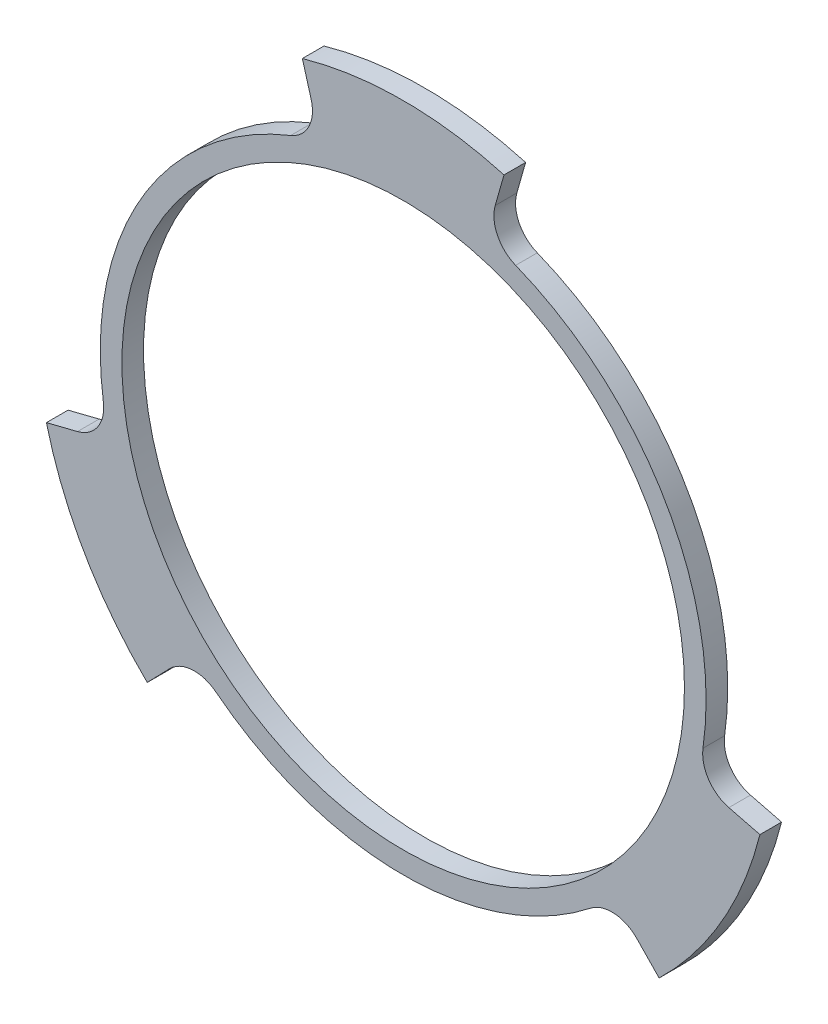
ISO-10303-21;
HEADER;
FILE_DESCRIPTION(('STEP AP214'),'2;1');
FILE_NAME('part.step','',(''),(''),'','','');
FILE_SCHEMA(('AUTOMOTIVE_DESIGN { 1 0 10303 214 1 1 1 1 }'));
ENDSEC;
DATA;
#1=APPLICATION_CONTEXT('core data for automotive mechanical design processes');
#2=APPLICATION_PROTOCOL_DEFINITION('international standard','automotive_design',2000,#1);
#3=PRODUCT_CONTEXT('',#1,'mechanical');
#4=PRODUCT('Part','Part','',(#3));
#5=PRODUCT_RELATED_PRODUCT_CATEGORY('part','',(#4));
#6=PRODUCT_DEFINITION_FORMATION('','',#4);
#7=PRODUCT_DEFINITION_CONTEXT('part definition',#1,'design');
#8=PRODUCT_DEFINITION('design','',#6,#7);
#9=PRODUCT_DEFINITION_SHAPE('','',#8);
#10=(LENGTH_UNIT() NAMED_UNIT(*) SI_UNIT(.MILLI.,.METRE.));
#11=(NAMED_UNIT(*) PLANE_ANGLE_UNIT() SI_UNIT($,.RADIAN.));
#12=(NAMED_UNIT(*) SI_UNIT($,.STERADIAN.) SOLID_ANGLE_UNIT());
#13=UNCERTAINTY_MEASURE_WITH_UNIT(LENGTH_MEASURE(1.E-05),#10,'distance_accuracy_value','');
#14=(GEOMETRIC_REPRESENTATION_CONTEXT(3) GLOBAL_UNCERTAINTY_ASSIGNED_CONTEXT((#13)) GLOBAL_UNIT_ASSIGNED_CONTEXT((#10,
#11,#12)) REPRESENTATION_CONTEXT('',''));
#15=CARTESIAN_POINT('',(0.,0.,0.));
#16=DIRECTION('',(0.,0.,1.));
#17=DIRECTION('',(1.,0.,0.));
#18=AXIS2_PLACEMENT_3D('',#15,#16,#17);
#19=CARTESIAN_POINT('',(0.,0.,1.5875));
#20=DIRECTION('',(0.,0.,-1.));
#21=DIRECTION('',(-1.,0.,0.));
#22=AXIS2_PLACEMENT_3D('',#19,#20,#21);
#23=CYLINDRICAL_SURFACE('',#22,22.225);
#24=CARTESIAN_POINT('',(0.,0.,0.));
#25=DIRECTION('',(0.,0.,1.));
#26=DIRECTION('',(1.,0.,0.));
#27=AXIS2_PLACEMENT_3D('',#24,#25,#26);
#28=CIRCLE('',#27,22.225);
#29=CARTESIAN_POINT('',(13.7457100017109,-17.4644233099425,0.));
#30=VERTEX_POINT('',#29);
#31=CARTESIAN_POINT('',(-13.7457100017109,-17.4644233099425,0.));
#32=VERTEX_POINT('',#31);
#33=EDGE_CURVE('E175',#30,#32,#28,.F.);
#34=ORIENTED_EDGE('',*,*,#33,.F.);
#35=DIRECTION('',(0.,0.,-1.));
#36=VECTOR('',#35,1.);
#37=CARTESIAN_POINT('',(13.7457100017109,-17.4644233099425,1.5875));
#38=LINE('',#37,#36);
#39=CARTESIAN_POINT('',(13.7457100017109,-17.4644233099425,1.5875));
#40=VERTEX_POINT('',#39);
#41=EDGE_CURVE('E277',#30,#40,#38,.F.);
#42=ORIENTED_EDGE('',*,*,#41,.T.);
#43=CARTESIAN_POINT('',(0.,0.,1.5875));
#44=DIRECTION('',(0.,0.,1.));
#45=DIRECTION('',(1.,0.,0.));
#46=AXIS2_PLACEMENT_3D('',#43,#44,#45);
#47=CIRCLE('',#46,22.225);
#48=CARTESIAN_POINT('',(-13.7457100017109,-17.4644233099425,1.5875));
#49=VERTEX_POINT('',#48);
#50=EDGE_CURVE('E213',#40,#49,#47,.F.);
#51=ORIENTED_EDGE('',*,*,#50,.T.);
#52=DIRECTION('',(0.,0.,-1.));
#53=VECTOR('',#52,1.);
#54=CARTESIAN_POINT('',(-13.7457100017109,-17.4644233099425,1.5875));
#55=LINE('',#54,#53);
#56=EDGE_CURVE('E274',#49,#32,#55,.T.);
#57=ORIENTED_EDGE('',*,*,#56,.T.);
#58=EDGE_LOOP('',(#34,#42,#51,#57));
#59=FACE_BOUND('',#58,.T.);
#60=ADVANCED_FACE('F31',(#59),#23,.T.);
#61=CARTESIAN_POINT('',(30.0428812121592,-31.0104715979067,1.5875));
#62=DIRECTION('',(-0.718223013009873,-0.695812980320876,0.));
#63=DIRECTION('',(0.695812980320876,-0.718223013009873,0.));
#64=AXIS2_PLACEMENT_3D('',#61,#62,#63);
#65=PLANE('',#64);
#66=DIRECTION('',(-0.695812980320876,0.718223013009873,0.));
#67=VECTOR('',#66,1.);
#68=CARTESIAN_POINT('',(30.0428812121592,-31.0104715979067,1.5875));
#69=LINE('',#68,#67);
#70=CARTESIAN_POINT('',(18.7782528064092,-19.3830435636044,1.5875));
#71=VERTEX_POINT('',#70);
#72=CARTESIAN_POINT('',(17.1409347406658,-17.6929924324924,1.5875));
#73=VERTEX_POINT('',#72);
#74=EDGE_CURVE('E216',#71,#73,#69,.T.);
#75=ORIENTED_EDGE('',*,*,#74,.T.);
#76=DIRECTION('',(0.,0.,1.));
#77=VECTOR('',#76,1.);
#78=CARTESIAN_POINT('',(17.1409347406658,-17.6929924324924,0.));
#79=LINE('',#78,#77);
#80=CARTESIAN_POINT('',(17.1409347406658,-17.6929924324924,0.));
#81=VERTEX_POINT('',#80);
#82=EDGE_CURVE('E173',#73,#81,#79,.F.);
#83=ORIENTED_EDGE('',*,*,#82,.T.);
#84=DIRECTION('',(-0.695812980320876,0.718223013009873,0.));
#85=VECTOR('',#84,1.);
#86=CARTESIAN_POINT('',(30.0428812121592,-31.0104715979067,0.));
#87=LINE('',#86,#85);
#88=CARTESIAN_POINT('',(18.7782528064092,-19.3830435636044,0.));
#89=VERTEX_POINT('',#88);
#90=EDGE_CURVE('E170',#89,#81,#87,.T.);
#91=ORIENTED_EDGE('',*,*,#90,.F.);
#92=DIRECTION('',(0.,0.,-1.));
#93=VECTOR('',#92,1.);
#94=CARTESIAN_POINT('',(18.7782528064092,-19.3830435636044,1.5875));
#95=LINE('',#94,#93);
#96=EDGE_CURVE('E155',#71,#89,#95,.T.);
#97=ORIENTED_EDGE('',*,*,#96,.F.);
#98=EDGE_LOOP('',(#75,#83,#91,#97));
#99=FACE_BOUND('',#98,.T.);
#100=ADVANCED_FACE('F171',(#99),#65,.T.);
#101=CARTESIAN_POINT('',(0.,0.,1.5875));
#102=DIRECTION('',(0.,0.,-1.));
#103=DIRECTION('',(-1.,0.,0.));
#104=AXIS2_PLACEMENT_3D('',#101,#102,#103);
#105=CYLINDRICAL_SURFACE('',#104,26.9875);
#106=CARTESIAN_POINT('',(0.,0.,0.));
#107=DIRECTION('',(0.,0.,1.));
#108=DIRECTION('',(1.,0.,0.));
#109=AXIS2_PLACEMENT_3D('',#106,#107,#108);
#110=CIRCLE('',#109,26.9875);
#111=CARTESIAN_POINT('',(26.1753345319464,-6.57092218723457,0.));
#112=VERTEX_POINT('',#111);
#113=EDGE_CURVE('E159',#112,#89,#110,.F.);
#114=ORIENTED_EDGE('',*,*,#113,.F.);
#115=DIRECTION('',(0.,0.,-1.));
#116=VECTOR('',#115,1.);
#117=CARTESIAN_POINT('',(26.1753345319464,-6.57092218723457,1.5875));
#118=LINE('',#117,#116);
#119=CARTESIAN_POINT('',(26.1753345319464,-6.57092218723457,1.5875));
#120=VERTEX_POINT('',#119);
#121=EDGE_CURVE('E166',#120,#112,#118,.T.);
#122=ORIENTED_EDGE('',*,*,#121,.F.);
#123=CARTESIAN_POINT('',(0.,0.,1.5875));
#124=DIRECTION('',(0.,0.,1.));
#125=DIRECTION('',(1.,0.,0.));
#126=AXIS2_PLACEMENT_3D('',#123,#124,#125);
#127=CIRCLE('',#126,26.9875);
#128=EDGE_CURVE('E161',#120,#71,#127,.F.);
#129=ORIENTED_EDGE('',*,*,#128,.T.);
#130=ORIENTED_EDGE('',*,*,#96,.T.);
#131=EDGE_LOOP('',(#114,#122,#129,#130));
#132=FACE_BOUND('',#131,.T.);
#133=ADVANCED_FACE('F157',(#132),#105,.T.);
#134=CARTESIAN_POINT('',(16.7948983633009,-4.21610543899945,1.5875));
#135=DIRECTION('',(-0.243480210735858,-0.969905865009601,0.));
#136=DIRECTION('',(0.969905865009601,-0.243480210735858,0.));
#137=AXIS2_PLACEMENT_3D('',#134,#135,#136);
#138=PLANE('',#137);
#139=DIRECTION('',(-0.969905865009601,0.243480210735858,0.));
#140=VECTOR('',#139,1.);
#141=CARTESIAN_POINT('',(16.7948983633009,-4.21610543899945,0.));
#142=LINE('',#141,#140);
#143=CARTESIAN_POINT('',(23.8930482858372,-5.99798871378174,0.));
#144=VERTEX_POINT('',#143);
#145=EDGE_CURVE('E181',#112,#144,#142,.T.);
#146=ORIENTED_EDGE('',*,*,#145,.T.);
#147=DIRECTION('',(0.,0.,1.));
#148=VECTOR('',#147,1.);
#149=CARTESIAN_POINT('',(23.8930482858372,-5.99798871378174,1.5875));
#150=LINE('',#149,#148);
#151=CARTESIAN_POINT('',(23.8930482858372,-5.99798871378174,1.5875));
#152=VERTEX_POINT('',#151);
#153=EDGE_CURVE('E268',#144,#152,#150,.T.);
#154=ORIENTED_EDGE('',*,*,#153,.T.);
#155=DIRECTION('',(-0.969905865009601,0.243480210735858,0.));
#156=VECTOR('',#155,1.);
#157=CARTESIAN_POINT('',(16.7948983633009,-4.21610543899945,1.5875));
#158=LINE('',#157,#156);
#159=EDGE_CURVE('E219',#120,#152,#158,.T.);
#160=ORIENTED_EDGE('',*,*,#159,.F.);
#161=ORIENTED_EDGE('',*,*,#121,.T.);
#162=EDGE_LOOP('',(#146,#154,#160,#161));
#163=FACE_BOUND('',#162,.T.);
#164=ADVANCED_FACE('F380',(#163),#138,.F.);
#165=CARTESIAN_POINT('',(0.,0.,1.5875));
#166=DIRECTION('',(0.,0.,-1.));
#167=DIRECTION('',(-1.,0.,0.));
#168=AXIS2_PLACEMENT_3D('',#165,#166,#167);
#169=CYLINDRICAL_SURFACE('',#168,22.225);
#170=CARTESIAN_POINT('',(0.,0.,1.5875));
#171=DIRECTION('',(0.,0.,1.));
#172=DIRECTION('',(1.,0.,0.));
#173=AXIS2_PLACEMENT_3D('',#170,#171,#172);
#174=CIRCLE('',#173,22.225);
#175=CARTESIAN_POINT('',(21.9974892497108,-3.17192239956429,1.5875));
#176=VERTEX_POINT('',#175);
#177=CARTESIAN_POINT('',(8.25177924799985,20.6363457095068,1.5875));
#178=VERTEX_POINT('',#177);
#179=EDGE_CURVE('E222',#176,#178,#174,.T.);
#180=ORIENTED_EDGE('',*,*,#179,.F.);
#181=DIRECTION('',(0.,0.,-1.));
#182=VECTOR('',#181,1.);
#183=CARTESIAN_POINT('',(21.9974892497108,-3.17192239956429,1.5875));
#184=LINE('',#183,#182);
#185=CARTESIAN_POINT('',(21.9974892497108,-3.17192239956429,0.));
#186=VERTEX_POINT('',#185);
#187=EDGE_CURVE('E265',#176,#186,#184,.T.);
#188=ORIENTED_EDGE('',*,*,#187,.T.);
#189=CARTESIAN_POINT('',(0.,0.,0.));
#190=DIRECTION('',(0.,0.,1.));
#191=DIRECTION('',(1.,0.,0.));
#192=AXIS2_PLACEMENT_3D('',#189,#190,#191);
#193=CIRCLE('',#192,22.225);
#194=CARTESIAN_POINT('',(8.25177924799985,20.6363457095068,0.));
#195=VERTEX_POINT('',#194);
#196=EDGE_CURVE('E183',#186,#195,#193,.T.);
#197=ORIENTED_EDGE('',*,*,#196,.T.);
#198=DIRECTION('',(0.,0.,-1.));
#199=VECTOR('',#198,1.);
#200=CARTESIAN_POINT('',(8.25177924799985,20.6363457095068,1.5875));
#201=LINE('',#200,#199);
#202=EDGE_CURVE('E263',#195,#178,#201,.F.);
#203=ORIENTED_EDGE('',*,*,#202,.T.);
#204=EDGE_LOOP('',(#180,#188,#197,#203));
#205=FACE_BOUND('',#204,.T.);
#206=ADVANCED_FACE('F343',(#205),#169,.T.);
#207=CARTESIAN_POINT('',(-14.6401058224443,-51.3673931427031,1.5875));
#208=DIRECTION('',(0.961703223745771,-0.274092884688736,0.));
#209=DIRECTION('',(0.274092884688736,0.961703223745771,0.));
#210=AXIS2_PLACEMENT_3D('',#207,#208,#209);
#211=PLANE('',#210);
#212=DIRECTION('',(-0.274092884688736,-0.961703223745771,0.));
#213=VECTOR('',#212,1.);
#214=CARTESIAN_POINT('',(-14.6401058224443,-51.3673931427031,1.5875));
#215=LINE('',#214,#213);
#216=CARTESIAN_POINT('',(7.39708172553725,25.953965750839,1.5875));
#217=VERTEX_POINT('',#216);
#218=CARTESIAN_POINT('',(6.7521135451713,23.6909811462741,1.5875));
#219=VERTEX_POINT('',#218);
#220=EDGE_CURVE('E225',#217,#219,#215,.T.);
#221=ORIENTED_EDGE('',*,*,#220,.T.);
#222=DIRECTION('',(0.,0.,-1.));
#223=VECTOR('',#222,1.);
#224=CARTESIAN_POINT('',(6.75211354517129,23.6909811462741,1.5875));
#225=LINE('',#224,#223);
#226=CARTESIAN_POINT('',(6.7521135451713,23.6909811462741,0.));
#227=VERTEX_POINT('',#226);
#228=EDGE_CURVE('E270',#219,#227,#225,.T.);
#229=ORIENTED_EDGE('',*,*,#228,.T.);
#230=DIRECTION('',(-0.274092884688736,-0.961703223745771,0.));
#231=VECTOR('',#230,1.);
#232=CARTESIAN_POINT('',(-14.6401058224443,-51.3673931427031,0.));
#233=LINE('',#232,#231);
#234=CARTESIAN_POINT('',(7.39708172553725,25.953965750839,0.));
#235=VERTEX_POINT('',#234);
#236=EDGE_CURVE('E189',#235,#227,#233,.T.);
#237=ORIENTED_EDGE('',*,*,#236,.F.);
#238=DIRECTION('',(0.,0.,-1.));
#239=VECTOR('',#238,1.);
#240=CARTESIAN_POINT('',(7.39708172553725,25.953965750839,1.5875));
#241=LINE('',#240,#239);
#242=EDGE_CURVE('E254',#217,#235,#241,.T.);
#243=ORIENTED_EDGE('',*,*,#242,.F.);
#244=EDGE_LOOP('',(#221,#229,#237,#243));
#245=FACE_BOUND('',#244,.T.);
#246=ADVANCED_FACE('F351',(#245),#211,.T.);
#247=CARTESIAN_POINT('',(0.,0.,1.5875));
#248=DIRECTION('',(0.,0.,-1.));
#249=DIRECTION('',(-1.,0.,0.));
#250=AXIS2_PLACEMENT_3D('',#247,#248,#249);
#251=CYLINDRICAL_SURFACE('',#250,26.9875);
#252=CARTESIAN_POINT('',(0.,0.,0.));
#253=DIRECTION('',(0.,0.,1.));
#254=DIRECTION('',(1.,0.,0.));
#255=AXIS2_PLACEMENT_3D('',#252,#253,#254);
#256=CIRCLE('',#255,26.9875);
#257=CARTESIAN_POINT('',(-7.39708172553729,25.953965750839,0.));
#258=VERTEX_POINT('',#257);
#259=EDGE_CURVE('E192',#258,#235,#256,.F.);
#260=ORIENTED_EDGE('',*,*,#259,.F.);
#261=DIRECTION('',(0.,0.,-1.));
#262=VECTOR('',#261,1.);
#263=CARTESIAN_POINT('',(-7.39708172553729,25.953965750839,1.5875));
#264=LINE('',#263,#262);
#265=CARTESIAN_POINT('',(-7.39708172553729,25.953965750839,1.5875));
#266=VERTEX_POINT('',#265);
#267=EDGE_CURVE('E252',#266,#258,#264,.T.);
#268=ORIENTED_EDGE('',*,*,#267,.F.);
#269=CARTESIAN_POINT('',(0.,0.,1.5875));
#270=DIRECTION('',(0.,0.,1.));
#271=DIRECTION('',(1.,0.,0.));
#272=AXIS2_PLACEMENT_3D('',#269,#270,#271);
#273=CIRCLE('',#272,26.9875);
#274=EDGE_CURVE('E228',#266,#217,#273,.F.);
#275=ORIENTED_EDGE('',*,*,#274,.T.);
#276=ORIENTED_EDGE('',*,*,#242,.T.);
#277=EDGE_LOOP('',(#260,#268,#275,#276));
#278=FACE_BOUND('',#277,.T.);
#279=ADVANCED_FACE('F356',(#278),#251,.T.);
#280=CARTESIAN_POINT('',(15.1884873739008,-53.2914865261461,1.5875));
#281=DIRECTION('',(0.96170322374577,0.274092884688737,0.));
#282=DIRECTION('',(-0.274092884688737,0.96170322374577,0.));
#283=AXIS2_PLACEMENT_3D('',#280,#281,#282);
#284=PLANE('',#283);
#285=DIRECTION('',(0.274092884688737,-0.96170322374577,0.));
#286=VECTOR('',#285,1.);
#287=CARTESIAN_POINT('',(15.1884873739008,-53.2914865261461,0.));
#288=LINE('',#287,#286);
#289=CARTESIAN_POINT('',(-6.75211354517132,23.6909811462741,0.));
#290=VERTEX_POINT('',#289);
#291=EDGE_CURVE('E195',#258,#290,#288,.T.);
#292=ORIENTED_EDGE('',*,*,#291,.T.);
#293=DIRECTION('',(0.,0.,-1.));
#294=VECTOR('',#293,1.);
#295=CARTESIAN_POINT('',(-6.75211354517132,23.6909811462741,1.5875));
#296=LINE('',#295,#294);
#297=CARTESIAN_POINT('',(-6.75211354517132,23.6909811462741,1.5875));
#298=VERTEX_POINT('',#297);
#299=EDGE_CURVE('E261',#290,#298,#296,.F.);
#300=ORIENTED_EDGE('',*,*,#299,.T.);
#301=DIRECTION('',(0.274092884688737,-0.96170322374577,0.));
#302=VECTOR('',#301,1.);
#303=CARTESIAN_POINT('',(15.1884873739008,-53.2914865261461,1.5875));
#304=LINE('',#303,#302);
#305=EDGE_CURVE('E231',#266,#298,#304,.T.);
#306=ORIENTED_EDGE('',*,*,#305,.F.);
#307=ORIENTED_EDGE('',*,*,#267,.T.);
#308=EDGE_LOOP('',(#292,#300,#306,#307));
#309=FACE_BOUND('',#308,.T.);
#310=ADVANCED_FACE('F360',(#309),#284,.F.);
#311=CARTESIAN_POINT('',(0.,0.,1.5875));
#312=DIRECTION('',(0.,0.,-1.));
#313=DIRECTION('',(-1.,0.,0.));
#314=AXIS2_PLACEMENT_3D('',#311,#312,#313);
#315=CYLINDRICAL_SURFACE('',#314,22.225);
#316=CARTESIAN_POINT('',(0.,0.,1.5875));
#317=DIRECTION('',(0.,0.,1.));
#318=DIRECTION('',(1.,0.,0.));
#319=AXIS2_PLACEMENT_3D('',#316,#317,#318);
#320=CIRCLE('',#319,22.225);
#321=CARTESIAN_POINT('',(-21.9974892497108,-3.17192239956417,1.5875));
#322=VERTEX_POINT('',#321);
#323=CARTESIAN_POINT('',(-8.25177924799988,20.6363457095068,1.5875));
#324=VERTEX_POINT('',#323);
#325=EDGE_CURVE('E234',#322,#324,#320,.F.);
#326=ORIENTED_EDGE('',*,*,#325,.T.);
#327=DIRECTION('',(0.,0.,-1.));
#328=VECTOR('',#327,1.);
#329=CARTESIAN_POINT('',(-8.25177924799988,20.6363457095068,1.5875));
#330=LINE('',#329,#328);
#331=CARTESIAN_POINT('',(-8.25177924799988,20.6363457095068,0.));
#332=VERTEX_POINT('',#331);
#333=EDGE_CURVE('E258',#324,#332,#330,.T.);
#334=ORIENTED_EDGE('',*,*,#333,.T.);
#335=CARTESIAN_POINT('',(0.,0.,0.));
#336=DIRECTION('',(0.,0.,1.));
#337=DIRECTION('',(1.,0.,0.));
#338=AXIS2_PLACEMENT_3D('',#335,#336,#337);
#339=CIRCLE('',#338,22.225);
#340=CARTESIAN_POINT('',(-21.9974892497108,-3.17192239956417,0.));
#341=VERTEX_POINT('',#340);
#342=EDGE_CURVE('E198',#341,#332,#339,.F.);
#343=ORIENTED_EDGE('',*,*,#342,.F.);
#344=DIRECTION('',(0.,0.,-1.));
#345=VECTOR('',#344,1.);
#346=CARTESIAN_POINT('',(-21.9974892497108,-3.17192239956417,1.5875));
#347=LINE('',#346,#345);
#348=EDGE_CURVE('E165',#341,#322,#347,.F.);
#349=ORIENTED_EDGE('',*,*,#348,.T.);
#350=EDGE_LOOP('',(#326,#334,#343,#349));
#351=FACE_BOUND('',#350,.T.);
#352=ADVANCED_FACE('F305',(#351),#315,.T.);
#353=CARTESIAN_POINT('',(-9.92822350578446,-2.49233048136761,1.5875));
#354=DIRECTION('',(-0.243480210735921,0.969905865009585,0.));
#355=DIRECTION('',(-0.969905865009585,-0.243480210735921,0.));
#356=AXIS2_PLACEMENT_3D('',#353,#354,#355);
#357=PLANE('',#356);
#358=DIRECTION('',(0.969905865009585,0.243480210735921,0.));
#359=VECTOR('',#358,1.);
#360=CARTESIAN_POINT('',(-9.92822350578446,-2.49233048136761,1.5875));
#361=LINE('',#360,#359);
#362=CARTESIAN_POINT('',(-26.1753345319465,-6.57092218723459,1.5875));
#363=VERTEX_POINT('',#362);
#364=CARTESIAN_POINT('',(-23.8930482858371,-5.99798871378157,1.5875));
#365=VERTEX_POINT('',#364);
#366=EDGE_CURVE('E237',#363,#365,#361,.T.);
#367=ORIENTED_EDGE('',*,*,#366,.T.);
#368=DIRECTION('',(0.,0.,1.));
#369=VECTOR('',#368,1.);
#370=CARTESIAN_POINT('',(-23.8930482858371,-5.99798871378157,0.));
#371=LINE('',#370,#369);
#372=CARTESIAN_POINT('',(-23.8930482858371,-5.99798871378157,0.));
#373=VERTEX_POINT('',#372);
#374=EDGE_CURVE('E281',#365,#373,#371,.F.);
#375=ORIENTED_EDGE('',*,*,#374,.T.);
#376=DIRECTION('',(0.969905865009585,0.243480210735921,0.));
#377=VECTOR('',#376,1.);
#378=CARTESIAN_POINT('',(-9.92822350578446,-2.49233048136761,0.));
#379=LINE('',#378,#377);
#380=CARTESIAN_POINT('',(-26.1753345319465,-6.57092218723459,0.));
#381=VERTEX_POINT('',#380);
#382=EDGE_CURVE('E201',#381,#373,#379,.T.);
#383=ORIENTED_EDGE('',*,*,#382,.F.);
#384=DIRECTION('',(0.,0.,-1.));
#385=VECTOR('',#384,1.);
#386=CARTESIAN_POINT('',(-26.1753345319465,-6.57092218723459,1.5875));
#387=LINE('',#386,#385);
#388=EDGE_CURVE('E250',#363,#381,#387,.T.);
#389=ORIENTED_EDGE('',*,*,#388,.F.);
#390=EDGE_LOOP('',(#367,#375,#383,#389));
#391=FACE_BOUND('',#390,.T.);
#392=ADVANCED_FACE('F309',(#391),#357,.T.);
#393=CARTESIAN_POINT('',(0.,0.,1.5875));
#394=DIRECTION('',(0.,0.,-1.));
#395=DIRECTION('',(-1.,0.,0.));
#396=AXIS2_PLACEMENT_3D('',#393,#394,#395);
#397=CYLINDRICAL_SURFACE('',#396,26.9875);
#398=CARTESIAN_POINT('',(0.,0.,0.));
#399=DIRECTION('',(0.,0.,1.));
#400=DIRECTION('',(1.,0.,0.));
#401=AXIS2_PLACEMENT_3D('',#398,#399,#400);
#402=CIRCLE('',#401,26.9875);
#403=CARTESIAN_POINT('',(-18.7782528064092,-19.3830435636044,0.));
#404=VERTEX_POINT('',#403);
#405=EDGE_CURVE('E204',#404,#381,#402,.F.);
#406=ORIENTED_EDGE('',*,*,#405,.F.);
#407=DIRECTION('',(0.,0.,-1.));
#408=VECTOR('',#407,1.);
#409=CARTESIAN_POINT('',(-18.7782528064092,-19.3830435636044,1.5875));
#410=LINE('',#409,#408);
#411=CARTESIAN_POINT('',(-18.7782528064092,-19.3830435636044,1.5875));
#412=VERTEX_POINT('',#411);
#413=EDGE_CURVE('E248',#412,#404,#410,.T.);
#414=ORIENTED_EDGE('',*,*,#413,.F.);
#415=CARTESIAN_POINT('',(0.,0.,1.5875));
#416=DIRECTION('',(0.,0.,1.));
#417=DIRECTION('',(1.,0.,0.));
#418=AXIS2_PLACEMENT_3D('',#415,#416,#417);
#419=CIRCLE('',#418,26.9875);
#420=EDGE_CURVE('E239',#412,#363,#419,.F.);
#421=ORIENTED_EDGE('',*,*,#420,.T.);
#422=ORIENTED_EDGE('',*,*,#388,.T.);
#423=EDGE_LOOP('',(#406,#414,#421,#422));
#424=FACE_BOUND('',#423,.T.);
#425=ADVANCED_FACE('F316',(#424),#397,.T.);
#426=CARTESIAN_POINT('',(-26.5088338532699,-27.3626032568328,1.5875));
#427=DIRECTION('',(-0.718223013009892,0.695812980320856,0.));
#428=DIRECTION('',(-0.695812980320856,-0.718223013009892,0.));
#429=AXIS2_PLACEMENT_3D('',#426,#427,#428);
#430=PLANE('',#429);
#431=DIRECTION('',(0.695812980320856,0.718223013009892,0.));
#432=VECTOR('',#431,1.);
#433=CARTESIAN_POINT('',(-26.5088338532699,-27.3626032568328,0.));
#434=LINE('',#433,#432);
#435=CARTESIAN_POINT('',(-17.1409347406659,-17.6929924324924,0.));
#436=VERTEX_POINT('',#435);
#437=EDGE_CURVE('E207',#404,#436,#434,.T.);
#438=ORIENTED_EDGE('',*,*,#437,.T.);
#439=DIRECTION('',(0.,0.,-1.));
#440=VECTOR('',#439,1.);
#441=CARTESIAN_POINT('',(-17.1409347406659,-17.6929924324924,1.5875));
#442=LINE('',#441,#440);
#443=CARTESIAN_POINT('',(-17.1409347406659,-17.6929924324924,1.5875));
#444=VERTEX_POINT('',#443);
#445=EDGE_CURVE('E279',#436,#444,#442,.F.);
#446=ORIENTED_EDGE('',*,*,#445,.T.);
#447=DIRECTION('',(0.695812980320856,0.718223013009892,0.));
#448=VECTOR('',#447,1.);
#449=CARTESIAN_POINT('',(-26.5088338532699,-27.3626032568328,1.5875));
#450=LINE('',#449,#448);
#451=EDGE_CURVE('E242',#412,#444,#450,.T.);
#452=ORIENTED_EDGE('',*,*,#451,.F.);
#453=ORIENTED_EDGE('',*,*,#413,.T.);
#454=EDGE_LOOP('',(#438,#446,#452,#453));
#455=FACE_BOUND('',#454,.T.);
#456=ADVANCED_FACE('F320',(#455),#430,.F.);
#457=CARTESIAN_POINT('',(0.,0.,1.5875));
#458=DIRECTION('',(0.,0.,-1.));
#459=DIRECTION('',(-1.,0.,0.));
#460=AXIS2_PLACEMENT_3D('',#457,#458,#459);
#461=CYLINDRICAL_SURFACE('',#460,20.6375);
#462=CARTESIAN_POINT('',(0.,0.,1.5875));
#463=DIRECTION('',(0.,0.,1.));
#464=DIRECTION('',(1.,0.,0.));
#465=AXIS2_PLACEMENT_3D('',#462,#463,#464);
#466=CIRCLE('',#465,20.6375);
#467=CARTESIAN_POINT('',(20.6375,0.,1.5875));
#468=VERTEX_POINT('',#467);
#469=EDGE_CURVE('E245',#468,#468,#466,.T.);
#470=ORIENTED_EDGE('',*,*,#469,.T.);
#471=EDGE_LOOP('',(#470));
#472=FACE_BOUND('',#471,.T.);
#473=CARTESIAN_POINT('',(0.,0.,0.));
#474=DIRECTION('',(0.,0.,1.));
#475=DIRECTION('',(1.,0.,0.));
#476=AXIS2_PLACEMENT_3D('',#473,#474,#475);
#477=CIRCLE('',#476,20.6375);
#478=CARTESIAN_POINT('',(20.6375,0.,0.));
#479=VERTEX_POINT('',#478);
#480=EDGE_CURVE('E210',#479,#479,#477,.T.);
#481=ORIENTED_EDGE('',*,*,#480,.F.);
#482=EDGE_LOOP('',(#481));
#483=FACE_BOUND('',#482,.T.);
#484=ADVANCED_FACE('F401',(#472,#483),#461,.F.);
#485=CARTESIAN_POINT('',(3.64970125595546,-56.5801301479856,1.5875));
#486=DIRECTION('',(0.,0.,1.));
#487=DIRECTION('',(1.,0.,0.));
#488=AXIS2_PLACEMENT_3D('',#485,#486,#487);
#489=PLANE('',#488);
#490=ORIENTED_EDGE('',*,*,#50,.F.);
#491=CARTESIAN_POINT('',(15.3166482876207,-19.4603574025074,1.5875));
#492=DIRECTION('',(0.,0.,1.));
#493=DIRECTION('',(1.,0.,0.));
#494=AXIS2_PLACEMENT_3D('',#491,#492,#493);
#495=CIRCLE('',#494,2.54);
#496=EDGE_CURVE('E297',#40,#73,#495,.F.);
#497=ORIENTED_EDGE('',*,*,#496,.T.);
#498=ORIENTED_EDGE('',*,*,#74,.F.);
#499=ORIENTED_EDGE('',*,*,#128,.F.);
#500=ORIENTED_EDGE('',*,*,#159,.T.);
#501=CARTESIAN_POINT('',(24.5114880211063,-3.53442781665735,1.5875));
#502=DIRECTION('',(0.,0.,1.));
#503=DIRECTION('',(1.,0.,0.));
#504=AXIS2_PLACEMENT_3D('',#501,#502,#503);
#505=CIRCLE('',#504,2.54);
#506=EDGE_CURVE('E289',#152,#176,#505,.F.);
#507=ORIENTED_EDGE('',*,*,#506,.T.);
#508=ORIENTED_EDGE('',*,*,#179,.T.);
#509=CARTESIAN_POINT('',(9.19483973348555,22.9947852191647,1.5875));
#510=DIRECTION('',(0.,0.,1.));
#511=DIRECTION('',(1.,0.,0.));
#512=AXIS2_PLACEMENT_3D('',#509,#510,#511);
#513=CIRCLE('',#512,2.54);
#514=EDGE_CURVE('E293',#178,#219,#513,.F.);
#515=ORIENTED_EDGE('',*,*,#514,.T.);
#516=ORIENTED_EDGE('',*,*,#220,.F.);
#517=ORIENTED_EDGE('',*,*,#274,.F.);
#518=ORIENTED_EDGE('',*,*,#305,.T.);
#519=CARTESIAN_POINT('',(-9.19483973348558,22.9947852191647,1.5875));
#520=DIRECTION('',(0.,0.,1.));
#521=DIRECTION('',(1.,0.,0.));
#522=AXIS2_PLACEMENT_3D('',#519,#520,#521);
#523=CIRCLE('',#522,2.54);
#524=EDGE_CURVE('E285',#298,#324,#523,.F.);
#525=ORIENTED_EDGE('',*,*,#524,.T.);
#526=ORIENTED_EDGE('',*,*,#325,.F.);
#527=CARTESIAN_POINT('',(-24.5114880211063,-3.53442781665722,1.5875));
#528=DIRECTION('',(0.,0.,1.));
#529=DIRECTION('',(1.,0.,0.));
#530=AXIS2_PLACEMENT_3D('',#527,#528,#529);
#531=CIRCLE('',#530,2.54);
#532=EDGE_CURVE('E11',#322,#365,#531,.F.);
#533=ORIENTED_EDGE('',*,*,#532,.T.);
#534=ORIENTED_EDGE('',*,*,#366,.F.);
#535=ORIENTED_EDGE('',*,*,#420,.F.);
#536=ORIENTED_EDGE('',*,*,#451,.T.);
#537=CARTESIAN_POINT('',(-15.3166482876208,-19.4603574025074,1.5875));
#538=DIRECTION('',(0.,0.,1.));
#539=DIRECTION('',(1.,0.,0.));
#540=AXIS2_PLACEMENT_3D('',#537,#538,#539);
#541=CIRCLE('',#540,2.54);
#542=EDGE_CURVE('E301',#444,#49,#541,.F.);
#543=ORIENTED_EDGE('',*,*,#542,.T.);
#544=EDGE_LOOP('',(#490,#497,#498,#499,#500,#507,#508,#515,#516,#517,#518,#525,#526,#533,#534,
#535,#536,#543));
#545=FACE_BOUND('',#544,.T.);
#546=ORIENTED_EDGE('',*,*,#469,.F.);
#547=EDGE_LOOP('',(#546));
#548=FACE_BOUND('',#547,.T.);
#549=ADVANCED_FACE('F312',(#545,#548),#489,.T.);
#550=CARTESIAN_POINT('',(3.64970125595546,-56.5801301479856,0.));
#551=DIRECTION('',(0.,0.,1.));
#552=DIRECTION('',(1.,0.,0.));
#553=AXIS2_PLACEMENT_3D('',#550,#551,#552);
#554=PLANE('',#553);
#555=ORIENTED_EDGE('',*,*,#90,.T.);
#556=CARTESIAN_POINT('',(15.3166482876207,-19.4603574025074,0.));
#557=DIRECTION('',(0.,0.,1.));
#558=DIRECTION('',(1.,0.,0.));
#559=AXIS2_PLACEMENT_3D('',#556,#557,#558);
#560=CIRCLE('',#559,2.54);
#561=EDGE_CURVE('E295',#81,#30,#560,.T.);
#562=ORIENTED_EDGE('',*,*,#561,.T.);
#563=ORIENTED_EDGE('',*,*,#33,.T.);
#564=CARTESIAN_POINT('',(-15.3166482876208,-19.4603574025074,0.));
#565=DIRECTION('',(0.,0.,1.));
#566=DIRECTION('',(1.,0.,0.));
#567=AXIS2_PLACEMENT_3D('',#564,#565,#566);
#568=CIRCLE('',#567,2.54);
#569=EDGE_CURVE('E299',#32,#436,#568,.T.);
#570=ORIENTED_EDGE('',*,*,#569,.T.);
#571=ORIENTED_EDGE('',*,*,#437,.F.);
#572=ORIENTED_EDGE('',*,*,#405,.T.);
#573=ORIENTED_EDGE('',*,*,#382,.T.);
#574=CARTESIAN_POINT('',(-24.5114880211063,-3.53442781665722,0.));
#575=DIRECTION('',(0.,0.,1.));
#576=DIRECTION('',(1.,0.,0.));
#577=AXIS2_PLACEMENT_3D('',#574,#575,#576);
#578=CIRCLE('',#577,2.54);
#579=EDGE_CURVE('E38',#373,#341,#578,.T.);
#580=ORIENTED_EDGE('',*,*,#579,.T.);
#581=ORIENTED_EDGE('',*,*,#342,.T.);
#582=CARTESIAN_POINT('',(-9.19483973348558,22.9947852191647,0.));
#583=DIRECTION('',(0.,0.,1.));
#584=DIRECTION('',(1.,0.,0.));
#585=AXIS2_PLACEMENT_3D('',#582,#583,#584);
#586=CIRCLE('',#585,2.54);
#587=EDGE_CURVE('E283',#332,#290,#586,.T.);
#588=ORIENTED_EDGE('',*,*,#587,.T.);
#589=ORIENTED_EDGE('',*,*,#291,.F.);
#590=ORIENTED_EDGE('',*,*,#259,.T.);
#591=ORIENTED_EDGE('',*,*,#236,.T.);
#592=CARTESIAN_POINT('',(9.19483973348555,22.9947852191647,0.));
#593=DIRECTION('',(0.,0.,1.));
#594=DIRECTION('',(1.,0.,0.));
#595=AXIS2_PLACEMENT_3D('',#592,#593,#594);
#596=CIRCLE('',#595,2.54);
#597=EDGE_CURVE('E291',#227,#195,#596,.T.);
#598=ORIENTED_EDGE('',*,*,#597,.T.);
#599=ORIENTED_EDGE('',*,*,#196,.F.);
#600=CARTESIAN_POINT('',(24.5114880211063,-3.53442781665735,0.));
#601=DIRECTION('',(0.,0.,1.));
#602=DIRECTION('',(1.,0.,0.));
#603=AXIS2_PLACEMENT_3D('',#600,#601,#602);
#604=CIRCLE('',#603,2.54);
#605=EDGE_CURVE('E287',#186,#144,#604,.T.);
#606=ORIENTED_EDGE('',*,*,#605,.T.);
#607=ORIENTED_EDGE('',*,*,#145,.F.);
#608=ORIENTED_EDGE('',*,*,#113,.T.);
#609=EDGE_LOOP('',(#555,#562,#563,#570,#571,#572,#573,#580,#581,#588,#589,#590,#591,#598,#599,
#606,#607,#608));
#610=FACE_BOUND('',#609,.T.);
#611=ORIENTED_EDGE('',*,*,#480,.T.);
#612=EDGE_LOOP('',(#611));
#613=FACE_BOUND('',#612,.T.);
#614=ADVANCED_FACE('F178',(#610,#613),#554,.F.);
#615=CARTESIAN_POINT('',(-9.19483973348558,22.9947852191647,1.5875));
#616=DIRECTION('',(0.,0.,-1.));
#617=DIRECTION('',(-1.,0.,0.));
#618=AXIS2_PLACEMENT_3D('',#615,#616,#617);
#619=CYLINDRICAL_SURFACE('',#618,2.54);
#620=ORIENTED_EDGE('',*,*,#524,.F.);
#621=ORIENTED_EDGE('',*,*,#299,.F.);
#622=ORIENTED_EDGE('',*,*,#587,.F.);
#623=ORIENTED_EDGE('',*,*,#333,.F.);
#624=EDGE_LOOP('',(#620,#621,#622,#623));
#625=FACE_BOUND('',#624,.T.);
#626=ADVANCED_FACE('F364',(#625),#619,.F.);
#627=CARTESIAN_POINT('',(24.5114880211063,-3.53442781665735,1.5875));
#628=DIRECTION('',(0.,0.,-1.));
#629=DIRECTION('',(-1.,0.,0.));
#630=AXIS2_PLACEMENT_3D('',#627,#628,#629);
#631=CYLINDRICAL_SURFACE('',#630,2.54);
#632=ORIENTED_EDGE('',*,*,#506,.F.);
#633=ORIENTED_EDGE('',*,*,#153,.F.);
#634=ORIENTED_EDGE('',*,*,#605,.F.);
#635=ORIENTED_EDGE('',*,*,#187,.F.);
#636=EDGE_LOOP('',(#632,#633,#634,#635));
#637=FACE_BOUND('',#636,.T.);
#638=ADVANCED_FACE('F340',(#637),#631,.F.);
#639=CARTESIAN_POINT('',(9.19483973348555,22.9947852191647,1.5875));
#640=DIRECTION('',(0.,0.,-1.));
#641=DIRECTION('',(-1.,0.,0.));
#642=AXIS2_PLACEMENT_3D('',#639,#640,#641);
#643=CYLINDRICAL_SURFACE('',#642,2.54);
#644=ORIENTED_EDGE('',*,*,#514,.F.);
#645=ORIENTED_EDGE('',*,*,#202,.F.);
#646=ORIENTED_EDGE('',*,*,#597,.F.);
#647=ORIENTED_EDGE('',*,*,#228,.F.);
#648=EDGE_LOOP('',(#644,#645,#646,#647));
#649=FACE_BOUND('',#648,.T.);
#650=ADVANCED_FACE('F349',(#649),#643,.F.);
#651=CARTESIAN_POINT('',(15.3166482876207,-19.4603574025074,1.5875));
#652=DIRECTION('',(0.,0.,-1.));
#653=DIRECTION('',(-1.,0.,0.));
#654=AXIS2_PLACEMENT_3D('',#651,#652,#653);
#655=CYLINDRICAL_SURFACE('',#654,2.54);
#656=ORIENTED_EDGE('',*,*,#496,.F.);
#657=ORIENTED_EDGE('',*,*,#41,.F.);
#658=ORIENTED_EDGE('',*,*,#561,.F.);
#659=ORIENTED_EDGE('',*,*,#82,.F.);
#660=EDGE_LOOP('',(#656,#657,#658,#659));
#661=FACE_BOUND('',#660,.T.);
#662=ADVANCED_FACE('F332',(#661),#655,.F.);
#663=CARTESIAN_POINT('',(-15.3166482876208,-19.4603574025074,1.5875));
#664=DIRECTION('',(0.,0.,-1.));
#665=DIRECTION('',(-1.,0.,0.));
#666=AXIS2_PLACEMENT_3D('',#663,#664,#665);
#667=CYLINDRICAL_SURFACE('',#666,2.54);
#668=ORIENTED_EDGE('',*,*,#542,.F.);
#669=ORIENTED_EDGE('',*,*,#445,.F.);
#670=ORIENTED_EDGE('',*,*,#569,.F.);
#671=ORIENTED_EDGE('',*,*,#56,.F.);
#672=EDGE_LOOP('',(#668,#669,#670,#671));
#673=FACE_BOUND('',#672,.T.);
#674=ADVANCED_FACE('F325',(#673),#667,.F.);
#675=CARTESIAN_POINT('',(-24.5114880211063,-3.53442781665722,1.5875));
#676=DIRECTION('',(0.,0.,-1.));
#677=DIRECTION('',(-1.,0.,0.));
#678=AXIS2_PLACEMENT_3D('',#675,#676,#677);
#679=CYLINDRICAL_SURFACE('',#678,2.54);
#680=ORIENTED_EDGE('',*,*,#532,.F.);
#681=ORIENTED_EDGE('',*,*,#348,.F.);
#682=ORIENTED_EDGE('',*,*,#579,.F.);
#683=ORIENTED_EDGE('',*,*,#374,.F.);
#684=EDGE_LOOP('',(#680,#681,#682,#683));
#685=FACE_BOUND('',#684,.T.);
#686=ADVANCED_FACE('F307',(#685),#679,.F.);
#687=CLOSED_SHELL('',(#60,#100,#133,#164,#206,#246,#279,#310,#352,#392,#425,#456,#484,#549,#614,
#626,#638,#650,#662,#674,#686));
#688=MANIFOLD_SOLID_BREP('B2',#687);
#689=ADVANCED_BREP_SHAPE_REPRESENTATION('',(#18,#688),#14);
#690=SHAPE_DEFINITION_REPRESENTATION(#9,#689);
ENDSEC;
END-ISO-10303-21;
